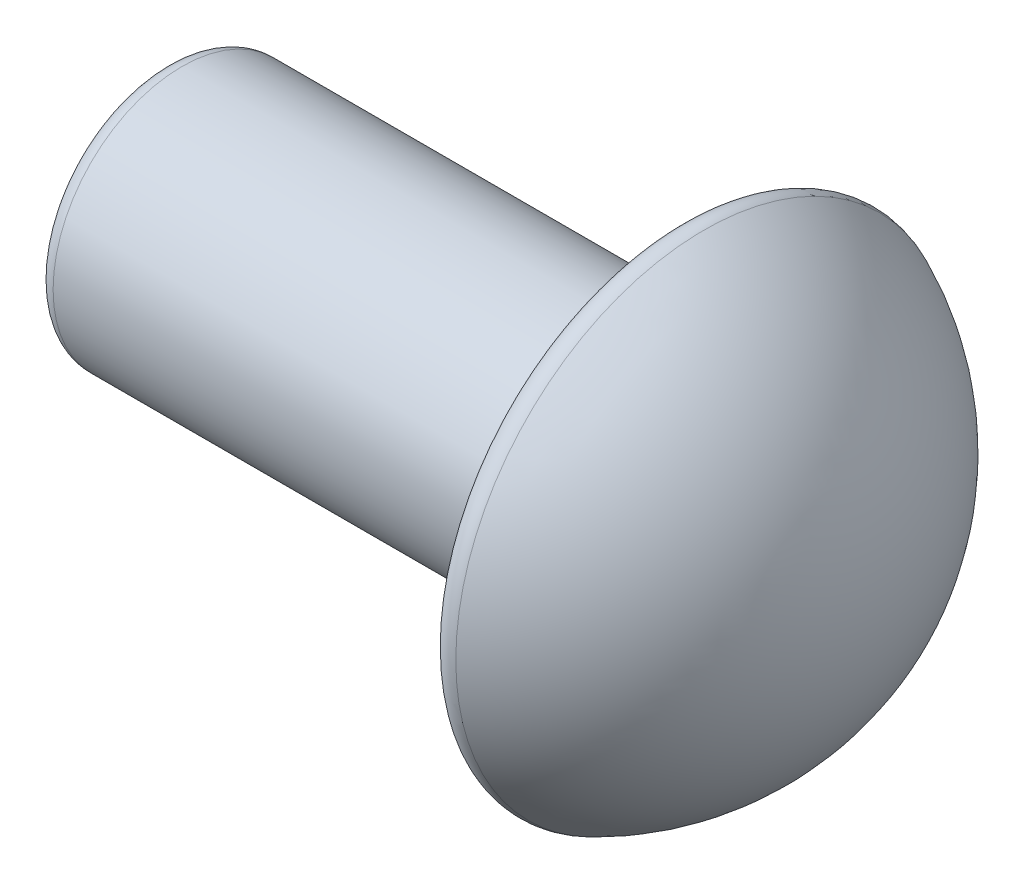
ISO-10303-21;
HEADER;
FILE_DESCRIPTION(('STEP AP214'),'2;1');
FILE_NAME('part.step','',(''),(''),'','','');
FILE_SCHEMA(('AUTOMOTIVE_DESIGN { 1 0 10303 214 1 1 1 1 }'));
ENDSEC;
DATA;
#1=APPLICATION_CONTEXT('core data for automotive mechanical design processes');
#2=APPLICATION_PROTOCOL_DEFINITION('international standard','automotive_design',2000,#1);
#3=PRODUCT_CONTEXT('',#1,'mechanical');
#4=PRODUCT('Part','Part','',(#3));
#5=PRODUCT_RELATED_PRODUCT_CATEGORY('part','',(#4));
#6=PRODUCT_DEFINITION_FORMATION('','',#4);
#7=PRODUCT_DEFINITION_CONTEXT('part definition',#1,'design');
#8=PRODUCT_DEFINITION('design','',#6,#7);
#9=PRODUCT_DEFINITION_SHAPE('','',#8);
#10=(LENGTH_UNIT() NAMED_UNIT(*) SI_UNIT(.MILLI.,.METRE.));
#11=(NAMED_UNIT(*) PLANE_ANGLE_UNIT() SI_UNIT($,.RADIAN.));
#12=(NAMED_UNIT(*) SI_UNIT($,.STERADIAN.) SOLID_ANGLE_UNIT());
#13=UNCERTAINTY_MEASURE_WITH_UNIT(LENGTH_MEASURE(1.E-05),#10,'distance_accuracy_value','');
#14=(GEOMETRIC_REPRESENTATION_CONTEXT(3) GLOBAL_UNCERTAINTY_ASSIGNED_CONTEXT((#13)) GLOBAL_UNIT_ASSIGNED_CONTEXT((#10,
#11,#12)) REPRESENTATION_CONTEXT('',''));
#15=CARTESIAN_POINT('',(0.,0.,0.));
#16=DIRECTION('',(0.,0.,1.));
#17=DIRECTION('',(1.,0.,0.));
#18=AXIS2_PLACEMENT_3D('',#15,#16,#17);
#19=CARTESIAN_POINT('',(5.,0.,0.));
#20=DIRECTION('',(1.,0.,0.));
#21=DIRECTION('',(0.,-1.,0.));
#22=AXIS2_PLACEMENT_3D('',#19,#20,#21);
#23=SPHERICAL_SURFACE('',#22,3.16227766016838);
#24=CARTESIAN_POINT('',(6.28101873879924,0.,0.));
#25=DIRECTION('',(-1.,0.,0.));
#26=DIRECTION('',(0.,0.,1.));
#27=AXIS2_PLACEMENT_3D('',#24,#25,#26);
#28=CIRCLE('',#27,2.89119196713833);
#29=CARTESIAN_POINT('',(6.28101873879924,0.,2.89119196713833));
#30=VERTEX_POINT('',#29);
#31=EDGE_CURVE('E10',#30,#30,#28,.F.);
#32=ORIENTED_EDGE('',*,*,#31,.T.);
#33=EDGE_LOOP('',(#32));
#34=FACE_BOUND('',#33,.T.);
#35=ADVANCED_FACE('F29',(#34),#23,.T.);
#36=CARTESIAN_POINT('',(6.,1.5,0.));
#37=DIRECTION('',(-1.,0.,0.));
#38=DIRECTION('',(0.,0.,1.));
#39=AXIS2_PLACEMENT_3D('',#36,#37,#38);
#40=PLANE('',#39);
#41=CARTESIAN_POINT('',(6.,0.,0.));
#42=DIRECTION('',(-1.,0.,0.));
#43=DIRECTION('',(0.,0.,1.));
#44=AXIS2_PLACEMENT_3D('',#41,#42,#43);
#45=CIRCLE('',#44,1.7);
#46=CARTESIAN_POINT('',(6.,0.,1.7));
#47=VERTEX_POINT('',#46);
#48=EDGE_CURVE('E48',#47,#47,#45,.F.);
#49=ORIENTED_EDGE('',*,*,#48,.T.);
#50=EDGE_LOOP('',(#49));
#51=FACE_BOUND('',#50,.T.);
#52=CARTESIAN_POINT('',(6.,0.,0.));
#53=DIRECTION('',(-1.,0.,0.));
#54=DIRECTION('',(0.,0.,1.));
#55=AXIS2_PLACEMENT_3D('',#52,#53,#54);
#56=CIRCLE('',#55,2.70833693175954);
#57=CARTESIAN_POINT('',(6.,0.,2.70833693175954));
#58=VERTEX_POINT('',#57);
#59=EDGE_CURVE('E51',#58,#58,#56,.T.);
#60=ORIENTED_EDGE('',*,*,#59,.T.);
#61=EDGE_LOOP('',(#60));
#62=FACE_BOUND('',#61,.T.);
#63=ADVANCED_FACE('F55',(#51,#62),#40,.T.);
#64=CARTESIAN_POINT('',(0.,0.,0.));
#65=DIRECTION('',(1.,0.,0.));
#66=DIRECTION('',(0.,0.,-1.));
#67=AXIS2_PLACEMENT_3D('',#64,#65,#66);
#68=CYLINDRICAL_SURFACE('',#67,1.5);
#69=CARTESIAN_POINT('',(5.8,0.,0.));
#70=DIRECTION('',(-1.,0.,0.));
#71=DIRECTION('',(0.,0.,1.));
#72=AXIS2_PLACEMENT_3D('',#69,#70,#71);
#73=CIRCLE('',#72,1.5);
#74=CARTESIAN_POINT('',(5.8,0.,1.5));
#75=VERTEX_POINT('',#74);
#76=EDGE_CURVE('E39',#75,#75,#73,.T.);
#77=ORIENTED_EDGE('',*,*,#76,.T.);
#78=EDGE_LOOP('',(#77));
#79=FACE_BOUND('',#78,.T.);
#80=CARTESIAN_POINT('',(0.2,0.,0.));
#81=DIRECTION('',(-1.,0.,0.));
#82=DIRECTION('',(0.,0.,1.));
#83=AXIS2_PLACEMENT_3D('',#80,#81,#82);
#84=CIRCLE('',#83,1.5);
#85=CARTESIAN_POINT('',(0.2,0.,1.5));
#86=VERTEX_POINT('',#85);
#87=EDGE_CURVE('E43',#86,#86,#84,.F.);
#88=ORIENTED_EDGE('',*,*,#87,.T.);
#89=EDGE_LOOP('',(#88));
#90=FACE_BOUND('',#89,.T.);
#91=ADVANCED_FACE('F72',(#79,#90),#68,.T.);
#92=CARTESIAN_POINT('',(0.,0.,0.));
#93=DIRECTION('',(-1.,0.,0.));
#94=DIRECTION('',(0.,0.,1.));
#95=AXIS2_PLACEMENT_3D('',#92,#93,#94);
#96=PLANE('',#95);
#97=CARTESIAN_POINT('',(0.,0.,0.));
#98=DIRECTION('',(-1.,0.,0.));
#99=DIRECTION('',(0.,0.,1.));
#100=AXIS2_PLACEMENT_3D('',#97,#98,#99);
#101=CIRCLE('',#100,1.3);
#102=CARTESIAN_POINT('',(0.,0.,1.3));
#103=VERTEX_POINT('',#102);
#104=EDGE_CURVE('E35',#103,#103,#101,.T.);
#105=ORIENTED_EDGE('',*,*,#104,.T.);
#106=EDGE_LOOP('',(#105));
#107=FACE_BOUND('',#106,.T.);
#108=ADVANCED_FACE('F77',(#107),#96,.T.);
#109=CARTESIAN_POINT('',(5.8,0.,0.));
#110=DIRECTION('',(-1.,0.,0.));
#111=DIRECTION('',(0.,0.,1.));
#112=AXIS2_PLACEMENT_3D('',#109,#110,#111);
#113=TOROIDAL_SURFACE('',#112,1.7,0.2);
#114=ORIENTED_EDGE('',*,*,#76,.F.);
#115=EDGE_LOOP('',(#114));
#116=FACE_BOUND('',#115,.T.);
#117=ORIENTED_EDGE('',*,*,#48,.F.);
#118=EDGE_LOOP('',(#117));
#119=FACE_BOUND('',#118,.T.);
#120=ADVANCED_FACE('F65',(#116,#119),#113,.F.);
#121=CARTESIAN_POINT('',(0.2,0.,0.));
#122=DIRECTION('',(-1.,0.,0.));
#123=DIRECTION('',(0.,0.,1.));
#124=AXIS2_PLACEMENT_3D('',#121,#122,#123);
#125=TOROIDAL_SURFACE('',#124,1.3,0.2);
#126=ORIENTED_EDGE('',*,*,#104,.F.);
#127=EDGE_LOOP('',(#126));
#128=FACE_BOUND('',#127,.T.);
#129=ORIENTED_EDGE('',*,*,#87,.F.);
#130=EDGE_LOOP('',(#129));
#131=FACE_BOUND('',#130,.T.);
#132=ADVANCED_FACE('F60',(#128,#131),#125,.T.);
#133=CARTESIAN_POINT('',(6.2,0.,0.));
#134=DIRECTION('',(-1.,0.,0.));
#135=DIRECTION('',(0.,0.,1.));
#136=AXIS2_PLACEMENT_3D('',#133,#134,#135);
#137=TOROIDAL_SURFACE('',#136,2.70833693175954,0.2);
#138=ORIENTED_EDGE('',*,*,#59,.F.);
#139=EDGE_LOOP('',(#138));
#140=FACE_BOUND('',#139,.T.);
#141=ORIENTED_EDGE('',*,*,#31,.F.);
#142=EDGE_LOOP('',(#141));
#143=FACE_BOUND('',#142,.T.);
#144=ADVANCED_FACE('F57',(#140,#143),#137,.T.);
#145=CLOSED_SHELL('',(#35,#63,#91,#108,#120,#132,#144));
#146=MANIFOLD_SOLID_BREP('B2',#145);
#147=ADVANCED_BREP_SHAPE_REPRESENTATION('',(#18,#146),#14);
#148=SHAPE_DEFINITION_REPRESENTATION(#9,#147);
ENDSEC;
END-ISO-10303-21;
